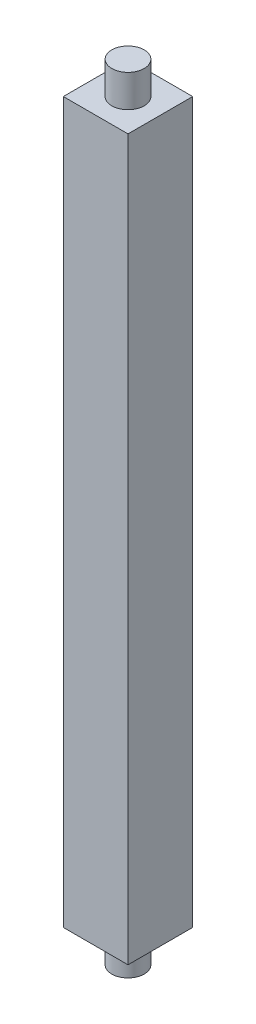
ISO-10303-21;
HEADER;
FILE_DESCRIPTION(('STEP AP214'),'2;1');
FILE_NAME('part.step','',(''),(''),'','','');
FILE_SCHEMA(('AUTOMOTIVE_DESIGN { 1 0 10303 214 1 1 1 1 }'));
ENDSEC;
DATA;
#1=APPLICATION_CONTEXT('core data for automotive mechanical design processes');
#2=APPLICATION_PROTOCOL_DEFINITION('international standard','automotive_design',2000,#1);
#3=PRODUCT_CONTEXT('',#1,'mechanical');
#4=PRODUCT('Part','Part','',(#3));
#5=PRODUCT_RELATED_PRODUCT_CATEGORY('part','',(#4));
#6=PRODUCT_DEFINITION_FORMATION('','',#4);
#7=PRODUCT_DEFINITION_CONTEXT('part definition',#1,'design');
#8=PRODUCT_DEFINITION('design','',#6,#7);
#9=PRODUCT_DEFINITION_SHAPE('','',#8);
#10=(LENGTH_UNIT() NAMED_UNIT(*) SI_UNIT(.MILLI.,.METRE.));
#11=(NAMED_UNIT(*) PLANE_ANGLE_UNIT() SI_UNIT($,.RADIAN.));
#12=(NAMED_UNIT(*) SI_UNIT($,.STERADIAN.) SOLID_ANGLE_UNIT());
#13=UNCERTAINTY_MEASURE_WITH_UNIT(LENGTH_MEASURE(1.E-05),#10,'distance_accuracy_value','');
#14=(GEOMETRIC_REPRESENTATION_CONTEXT(3) GLOBAL_UNCERTAINTY_ASSIGNED_CONTEXT((#13)) GLOBAL_UNIT_ASSIGNED_CONTEXT((#10,
#11,#12)) REPRESENTATION_CONTEXT('',''));
#15=CARTESIAN_POINT('',(0.,0.,0.));
#16=DIRECTION('',(0.,0.,1.));
#17=DIRECTION('',(1.,0.,0.));
#18=AXIS2_PLACEMENT_3D('',#15,#16,#17);
#19=CARTESIAN_POINT('',(0.,0.,0.));
#20=DIRECTION('',(0.,-1.,0.));
#21=DIRECTION('',(0.,0.,-1.));
#22=AXIS2_PLACEMENT_3D('',#19,#20,#21);
#23=PLANE('',#22);
#24=DIRECTION('',(0.,0.,-1.));
#25=VECTOR('',#24,1.);
#26=CARTESIAN_POINT('',(2.,0.,2.));
#27=LINE('',#26,#25);
#28=CARTESIAN_POINT('',(2.,0.,2.));
#29=VERTEX_POINT('',#28);
#30=CARTESIAN_POINT('',(2.,0.,-2.));
#31=VERTEX_POINT('',#30);
#32=EDGE_CURVE('E101',#29,#31,#27,.T.);
#33=ORIENTED_EDGE('',*,*,#32,.F.);
#34=DIRECTION('',(1.,0.,0.));
#35=VECTOR('',#34,1.);
#36=CARTESIAN_POINT('',(-2.,0.,2.));
#37=LINE('',#36,#35);
#38=CARTESIAN_POINT('',(-2.,0.,2.));
#39=VERTEX_POINT('',#38);
#40=EDGE_CURVE('E73',#39,#29,#37,.T.);
#41=ORIENTED_EDGE('',*,*,#40,.F.);
#42=DIRECTION('',(0.,0.,1.));
#43=VECTOR('',#42,1.);
#44=CARTESIAN_POINT('',(-2.,0.,2.));
#45=LINE('',#44,#43);
#46=CARTESIAN_POINT('',(-2.,0.,-2.));
#47=VERTEX_POINT('',#46);
#48=EDGE_CURVE('E67',#47,#39,#45,.T.);
#49=ORIENTED_EDGE('',*,*,#48,.F.);
#50=DIRECTION('',(-1.,0.,0.));
#51=VECTOR('',#50,1.);
#52=CARTESIAN_POINT('',(-2.,0.,-2.));
#53=LINE('',#52,#51);
#54=EDGE_CURVE('E92',#31,#47,#53,.T.);
#55=ORIENTED_EDGE('',*,*,#54,.F.);
#56=EDGE_LOOP('',(#33,#41,#49,#55));
#57=FACE_BOUND('',#56,.T.);
#58=CARTESIAN_POINT('',(0.,0.,0.));
#59=DIRECTION('',(0.,-1.,0.));
#60=DIRECTION('',(0.,0.,-1.));
#61=AXIS2_PLACEMENT_3D('',#58,#59,#60);
#62=CIRCLE('',#61,1.);
#63=CARTESIAN_POINT('',(0.,0.,-1.));
#64=VERTEX_POINT('',#63);
#65=EDGE_CURVE('E117',#64,#64,#62,.T.);
#66=ORIENTED_EDGE('',*,*,#65,.F.);
#67=EDGE_LOOP('',(#66));
#68=FACE_BOUND('',#67,.T.);
#69=ADVANCED_FACE('F33',(#57,#68),#23,.T.);
#70=CARTESIAN_POINT('',(0.,44.5,0.));
#71=DIRECTION('',(0.,-1.,0.));
#72=DIRECTION('',(0.,0.,-1.));
#73=AXIS2_PLACEMENT_3D('',#70,#71,#72);
#74=PLANE('',#73);
#75=DIRECTION('',(0.,0.,-1.));
#76=VECTOR('',#75,1.);
#77=CARTESIAN_POINT('',(2.,44.5,2.));
#78=LINE('',#77,#76);
#79=CARTESIAN_POINT('',(2.,44.5,2.));
#80=VERTEX_POINT('',#79);
#81=CARTESIAN_POINT('',(2.,44.5,-2.));
#82=VERTEX_POINT('',#81);
#83=EDGE_CURVE('E87',#80,#82,#78,.T.);
#84=ORIENTED_EDGE('',*,*,#83,.T.);
#85=DIRECTION('',(-1.,0.,0.));
#86=VECTOR('',#85,1.);
#87=CARTESIAN_POINT('',(-2.,44.5,-2.));
#88=LINE('',#87,#86);
#89=CARTESIAN_POINT('',(-2.,44.5,-2.));
#90=VERTEX_POINT('',#89);
#91=EDGE_CURVE('E81',#82,#90,#88,.T.);
#92=ORIENTED_EDGE('',*,*,#91,.T.);
#93=DIRECTION('',(0.,0.,1.));
#94=VECTOR('',#93,1.);
#95=CARTESIAN_POINT('',(-2.,44.5,2.));
#96=LINE('',#95,#94);
#97=CARTESIAN_POINT('',(-2.,44.5,2.));
#98=VERTEX_POINT('',#97);
#99=EDGE_CURVE('E85',#90,#98,#96,.T.);
#100=ORIENTED_EDGE('',*,*,#99,.T.);
#101=DIRECTION('',(1.,0.,0.));
#102=VECTOR('',#101,1.);
#103=CARTESIAN_POINT('',(-2.,44.5,2.));
#104=LINE('',#103,#102);
#105=EDGE_CURVE('E50',#98,#80,#104,.T.);
#106=ORIENTED_EDGE('',*,*,#105,.T.);
#107=EDGE_LOOP('',(#84,#92,#100,#106));
#108=FACE_BOUND('',#107,.T.);
#109=CARTESIAN_POINT('',(0.,44.5,0.));
#110=DIRECTION('',(0.,-1.,0.));
#111=DIRECTION('',(0.,0.,-1.));
#112=AXIS2_PLACEMENT_3D('',#109,#110,#111);
#113=CIRCLE('',#112,1.);
#114=CARTESIAN_POINT('',(0.,44.5,-1.));
#115=VERTEX_POINT('',#114);
#116=EDGE_CURVE('E11',#115,#115,#113,.F.);
#117=ORIENTED_EDGE('',*,*,#116,.F.);
#118=EDGE_LOOP('',(#117));
#119=FACE_BOUND('',#118,.T.);
#120=ADVANCED_FACE('F82',(#108,#119),#74,.F.);
#121=CARTESIAN_POINT('',(2.,44.5,2.));
#122=DIRECTION('',(-1.,0.,0.));
#123=DIRECTION('',(0.,0.,1.));
#124=AXIS2_PLACEMENT_3D('',#121,#122,#123);
#125=PLANE('',#124);
#126=ORIENTED_EDGE('',*,*,#32,.T.);
#127=DIRECTION('',(0.,-1.,0.));
#128=VECTOR('',#127,1.);
#129=CARTESIAN_POINT('',(2.,44.5,-2.));
#130=LINE('',#129,#128);
#131=EDGE_CURVE('E42',#82,#31,#130,.T.);
#132=ORIENTED_EDGE('',*,*,#131,.F.);
#133=ORIENTED_EDGE('',*,*,#83,.F.);
#134=DIRECTION('',(0.,-1.,0.));
#135=VECTOR('',#134,1.);
#136=CARTESIAN_POINT('',(2.,44.5,2.));
#137=LINE('',#136,#135);
#138=EDGE_CURVE('E97',#80,#29,#137,.T.);
#139=ORIENTED_EDGE('',*,*,#138,.T.);
#140=EDGE_LOOP('',(#126,#132,#133,#139));
#141=FACE_BOUND('',#140,.T.);
#142=ADVANCED_FACE('F35',(#141),#125,.F.);
#143=CARTESIAN_POINT('',(-2.,44.5,-2.));
#144=DIRECTION('',(0.,0.,1.));
#145=DIRECTION('',(1.,0.,0.));
#146=AXIS2_PLACEMENT_3D('',#143,#144,#145);
#147=PLANE('',#146);
#148=ORIENTED_EDGE('',*,*,#54,.T.);
#149=DIRECTION('',(0.,-1.,0.));
#150=VECTOR('',#149,1.);
#151=CARTESIAN_POINT('',(-2.,44.5,-2.));
#152=LINE('',#151,#150);
#153=EDGE_CURVE('E90',#90,#47,#152,.T.);
#154=ORIENTED_EDGE('',*,*,#153,.F.);
#155=ORIENTED_EDGE('',*,*,#91,.F.);
#156=ORIENTED_EDGE('',*,*,#131,.T.);
#157=EDGE_LOOP('',(#148,#154,#155,#156));
#158=FACE_BOUND('',#157,.T.);
#159=ADVANCED_FACE('F91',(#158),#147,.F.);
#160=CARTESIAN_POINT('',(-2.,44.5,2.));
#161=DIRECTION('',(1.,0.,0.));
#162=DIRECTION('',(0.,0.,-1.));
#163=AXIS2_PLACEMENT_3D('',#160,#161,#162);
#164=PLANE('',#163);
#165=ORIENTED_EDGE('',*,*,#48,.T.);
#166=DIRECTION('',(0.,-1.,0.));
#167=VECTOR('',#166,1.);
#168=CARTESIAN_POINT('',(-2.,44.5,2.));
#169=LINE('',#168,#167);
#170=EDGE_CURVE('E93',#98,#39,#169,.T.);
#171=ORIENTED_EDGE('',*,*,#170,.F.);
#172=ORIENTED_EDGE('',*,*,#99,.F.);
#173=ORIENTED_EDGE('',*,*,#153,.T.);
#174=EDGE_LOOP('',(#165,#171,#172,#173));
#175=FACE_BOUND('',#174,.T.);
#176=ADVANCED_FACE('F95',(#175),#164,.F.);
#177=CARTESIAN_POINT('',(-2.,44.5,2.));
#178=DIRECTION('',(0.,0.,-1.));
#179=DIRECTION('',(-1.,0.,0.));
#180=AXIS2_PLACEMENT_3D('',#177,#178,#179);
#181=PLANE('',#180);
#182=ORIENTED_EDGE('',*,*,#40,.T.);
#183=ORIENTED_EDGE('',*,*,#138,.F.);
#184=ORIENTED_EDGE('',*,*,#105,.F.);
#185=ORIENTED_EDGE('',*,*,#170,.T.);
#186=EDGE_LOOP('',(#182,#183,#184,#185));
#187=FACE_BOUND('',#186,.T.);
#188=ADVANCED_FACE('F132',(#187),#181,.F.);
#189=CARTESIAN_POINT('',(0.,46.5,0.));
#190=DIRECTION('',(0.,-1.,0.));
#191=DIRECTION('',(0.,0.,-1.));
#192=AXIS2_PLACEMENT_3D('',#189,#190,#191);
#193=CYLINDRICAL_SURFACE('',#192,1.);
#194=CARTESIAN_POINT('',(0.,46.5,0.));
#195=DIRECTION('',(0.,1.,0.));
#196=DIRECTION('',(0.,0.,1.));
#197=AXIS2_PLACEMENT_3D('',#194,#195,#196);
#198=CIRCLE('',#197,1.);
#199=CARTESIAN_POINT('',(0.,46.5,1.));
#200=VERTEX_POINT('',#199);
#201=EDGE_CURVE('E104',#200,#200,#198,.T.);
#202=ORIENTED_EDGE('',*,*,#201,.F.);
#203=EDGE_LOOP('',(#202));
#204=FACE_BOUND('',#203,.T.);
#205=ORIENTED_EDGE('',*,*,#116,.T.);
#206=EDGE_LOOP('',(#205));
#207=FACE_BOUND('',#206,.T.);
#208=ADVANCED_FACE('F129',(#204,#207),#193,.T.);
#209=CARTESIAN_POINT('',(0.,46.5,0.));
#210=DIRECTION('',(0.,1.,0.));
#211=DIRECTION('',(0.,0.,1.));
#212=AXIS2_PLACEMENT_3D('',#209,#210,#211);
#213=PLANE('',#212);
#214=ORIENTED_EDGE('',*,*,#201,.T.);
#215=EDGE_LOOP('',(#214));
#216=FACE_BOUND('',#215,.T.);
#217=ADVANCED_FACE('F127',(#216),#213,.T.);
#218=CARTESIAN_POINT('',(0.,-2.,0.));
#219=DIRECTION('',(0.,1.,0.));
#220=DIRECTION('',(0.,0.,1.));
#221=AXIS2_PLACEMENT_3D('',#218,#219,#220);
#222=CYLINDRICAL_SURFACE('',#221,1.);
#223=CARTESIAN_POINT('',(0.,-2.,0.));
#224=DIRECTION('',(0.,-1.,0.));
#225=DIRECTION('',(0.,0.,-1.));
#226=AXIS2_PLACEMENT_3D('',#223,#224,#225);
#227=CIRCLE('',#226,1.);
#228=CARTESIAN_POINT('',(0.,-2.,-1.));
#229=VERTEX_POINT('',#228);
#230=EDGE_CURVE('E119',#229,#229,#227,.T.);
#231=ORIENTED_EDGE('',*,*,#230,.F.);
#232=EDGE_LOOP('',(#231));
#233=FACE_BOUND('',#232,.T.);
#234=ORIENTED_EDGE('',*,*,#65,.T.);
#235=EDGE_LOOP('',(#234));
#236=FACE_BOUND('',#235,.T.);
#237=ADVANCED_FACE('F168',(#233,#236),#222,.T.);
#238=CARTESIAN_POINT('',(0.,-2.,0.));
#239=DIRECTION('',(0.,-1.,0.));
#240=DIRECTION('',(0.,0.,-1.));
#241=AXIS2_PLACEMENT_3D('',#238,#239,#240);
#242=PLANE('',#241);
#243=ORIENTED_EDGE('',*,*,#230,.T.);
#244=EDGE_LOOP('',(#243));
#245=FACE_BOUND('',#244,.T.);
#246=ADVANCED_FACE('F175',(#245),#242,.T.);
#247=CLOSED_SHELL('',(#69,#120,#142,#159,#176,#188,#208,#217,#237,#246));
#248=MANIFOLD_SOLID_BREP('B2',#247);
#249=ADVANCED_BREP_SHAPE_REPRESENTATION('',(#18,#248),#14);
#250=SHAPE_DEFINITION_REPRESENTATION(#9,#249);
ENDSEC;
END-ISO-10303-21;
